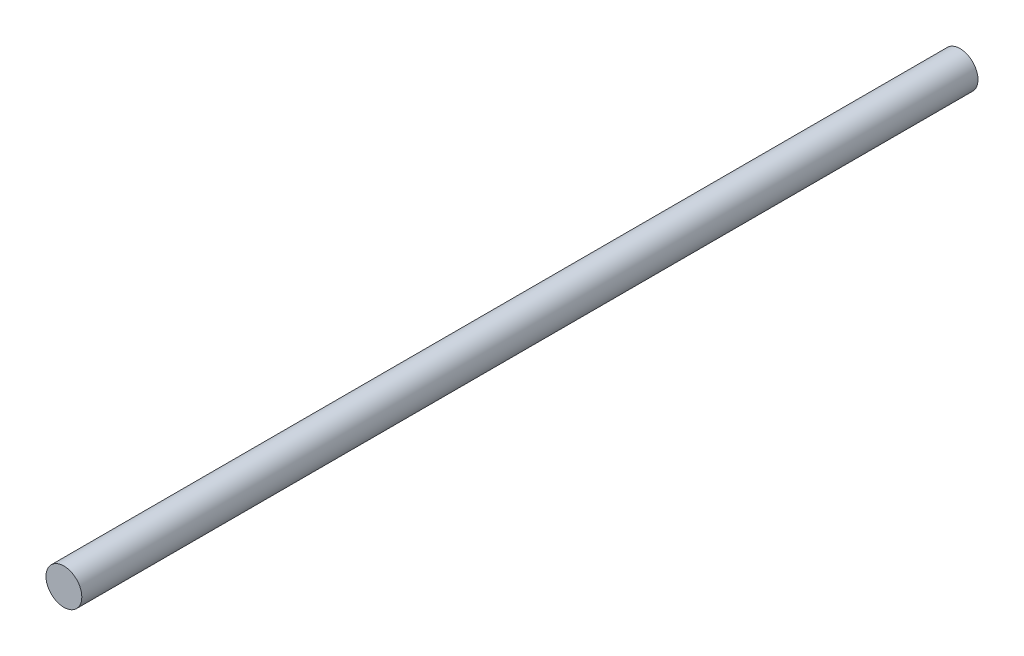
ISO-10303-21;
HEADER;
FILE_DESCRIPTION(('STEP AP214'),'2;1');
FILE_NAME('part.step','',(''),(''),'','','');
FILE_SCHEMA(('AUTOMOTIVE_DESIGN { 1 0 10303 214 1 1 1 1 }'));
ENDSEC;
DATA;
#1=APPLICATION_CONTEXT('core data for automotive mechanical design processes');
#2=APPLICATION_PROTOCOL_DEFINITION('international standard','automotive_design',2000,#1);
#3=PRODUCT_CONTEXT('',#1,'mechanical');
#4=PRODUCT('Part','Part','',(#3));
#5=PRODUCT_RELATED_PRODUCT_CATEGORY('part','',(#4));
#6=PRODUCT_DEFINITION_FORMATION('','',#4);
#7=PRODUCT_DEFINITION_CONTEXT('part definition',#1,'design');
#8=PRODUCT_DEFINITION('design','',#6,#7);
#9=PRODUCT_DEFINITION_SHAPE('','',#8);
#10=(LENGTH_UNIT() NAMED_UNIT(*) SI_UNIT(.MILLI.,.METRE.));
#11=(NAMED_UNIT(*) PLANE_ANGLE_UNIT() SI_UNIT($,.RADIAN.));
#12=(NAMED_UNIT(*) SI_UNIT($,.STERADIAN.) SOLID_ANGLE_UNIT());
#13=UNCERTAINTY_MEASURE_WITH_UNIT(LENGTH_MEASURE(1.E-05),#10,'distance_accuracy_value','');
#14=(GEOMETRIC_REPRESENTATION_CONTEXT(3) GLOBAL_UNCERTAINTY_ASSIGNED_CONTEXT((#13)) GLOBAL_UNIT_ASSIGNED_CONTEXT((#10,
#11,#12)) REPRESENTATION_CONTEXT('',''));
#15=CARTESIAN_POINT('',(0.,0.,0.));
#16=DIRECTION('',(0.,0.,1.));
#17=DIRECTION('',(1.,0.,0.));
#18=AXIS2_PLACEMENT_3D('',#15,#16,#17);
#19=CARTESIAN_POINT('',(0.,0.,400.));
#20=DIRECTION('',(0.,0.,1.));
#21=DIRECTION('',(1.,0.,0.));
#22=AXIS2_PLACEMENT_3D('',#19,#20,#21);
#23=PLANE('',#22);
#24=CARTESIAN_POINT('',(0.,0.,400.));
#25=DIRECTION('',(0.,0.,1.));
#26=DIRECTION('',(1.,0.,0.));
#27=AXIS2_PLACEMENT_3D('',#24,#25,#26);
#28=CIRCLE('',#27,8.);
#29=CARTESIAN_POINT('',(8.,0.,400.));
#30=VERTEX_POINT('',#29);
#31=EDGE_CURVE('E10',#30,#30,#28,.T.);
#32=ORIENTED_EDGE('',*,*,#31,.T.);
#33=EDGE_LOOP('',(#32));
#34=FACE_BOUND('',#33,.T.);
#35=ADVANCED_FACE('F16',(#34),#23,.T.);
#36=CARTESIAN_POINT('',(0.,0.,0.));
#37=DIRECTION('',(0.,0.,1.));
#38=DIRECTION('',(1.,0.,0.));
#39=AXIS2_PLACEMENT_3D('',#36,#37,#38);
#40=PLANE('',#39);
#41=CARTESIAN_POINT('',(0.,0.,0.));
#42=DIRECTION('',(0.,0.,1.));
#43=DIRECTION('',(1.,0.,0.));
#44=AXIS2_PLACEMENT_3D('',#41,#42,#43);
#45=CIRCLE('',#44,8.);
#46=CARTESIAN_POINT('',(8.,0.,0.));
#47=VERTEX_POINT('',#46);
#48=EDGE_CURVE('E41',#47,#47,#45,.T.);
#49=ORIENTED_EDGE('',*,*,#48,.F.);
#50=EDGE_LOOP('',(#49));
#51=FACE_BOUND('',#50,.T.);
#52=ADVANCED_FACE('F55',(#51),#40,.F.);
#53=CARTESIAN_POINT('',(0.,0.,0.));
#54=DIRECTION('',(0.,0.,-1.));
#55=DIRECTION('',(1.,0.,0.));
#56=AXIS2_PLACEMENT_3D('',#53,#54,#55);
#57=CYLINDRICAL_SURFACE('',#56,8.);
#58=ORIENTED_EDGE('',*,*,#48,.T.);
#59=DIRECTION('',(0.,0.,1.));
#60=VECTOR('',#59,1.);
#61=CARTESIAN_POINT('',(8.,0.,0.));
#62=LINE('',#61,#60);
#63=EDGE_CURVE('E25',#47,#30,#62,.T.);
#64=ORIENTED_EDGE('',*,*,#63,.T.);
#65=ORIENTED_EDGE('',*,*,#31,.F.);
#66=ORIENTED_EDGE('',*,*,#63,.F.);
#67=EDGE_LOOP('',(#58,#64,#65,#66));
#68=FACE_BOUND('',#67,.T.);
#69=ADVANCED_FACE('F39',(#68),#57,.T.);
#70=CLOSED_SHELL('',(#35,#52,#69));
#71=MANIFOLD_SOLID_BREP('B1',#70);
#72=ADVANCED_BREP_SHAPE_REPRESENTATION('',(#18,#71),#14);
#73=SHAPE_DEFINITION_REPRESENTATION(#9,#72);
ENDSEC;
END-ISO-10303-21;
